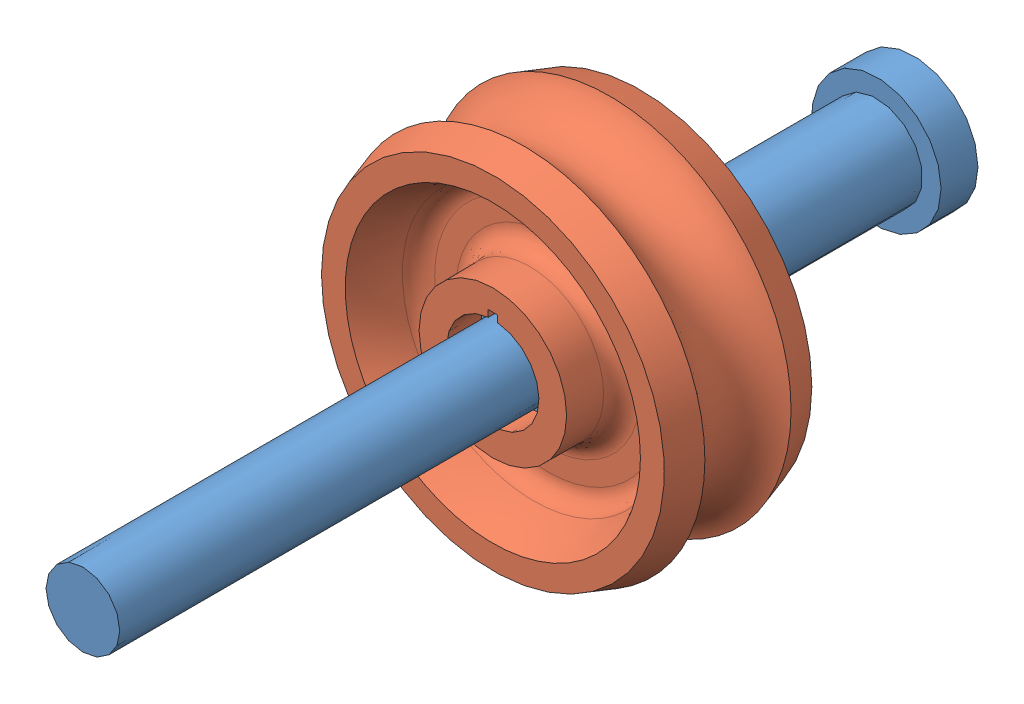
SolidWorks assembly SubAssy.SLDASM, configuration Default (file format 3100). Lengths in mm.
Overall size (62.43 62.43 142.95).
2 component instances, 2 part files, 5 mates.
Components (placement in the parent):
- Worm Gear Shaft-1: Worm Gear Shaft.SLDPRT [Default] at origin size (22.23 22.23 142.95)
- Worm Gear-1: Worm Gear.SLDPRT [Default] at (0 0 53.34) size (62.43 62.43 25.4)
Mates (geometry in assembly coordinates):
- Coincident1: coincident aligned: plane of Worm Gear Shaft-1; plane of assembly
- Coincident2: coincident aligned: plane of Worm Gear Shaft-1; plane of assembly
- Coincident3: coincident aligned: plane of Worm Gear Shaft-1; plane of assembly
- Concentric1: concentric anti-aligned: cylinder of Worm Gear Shaft-1; cylinder of Worm Gear-1
- Coincident4: coincident aligned: plane of Worm Gear Shaft-1; plane of Worm Gear-1
